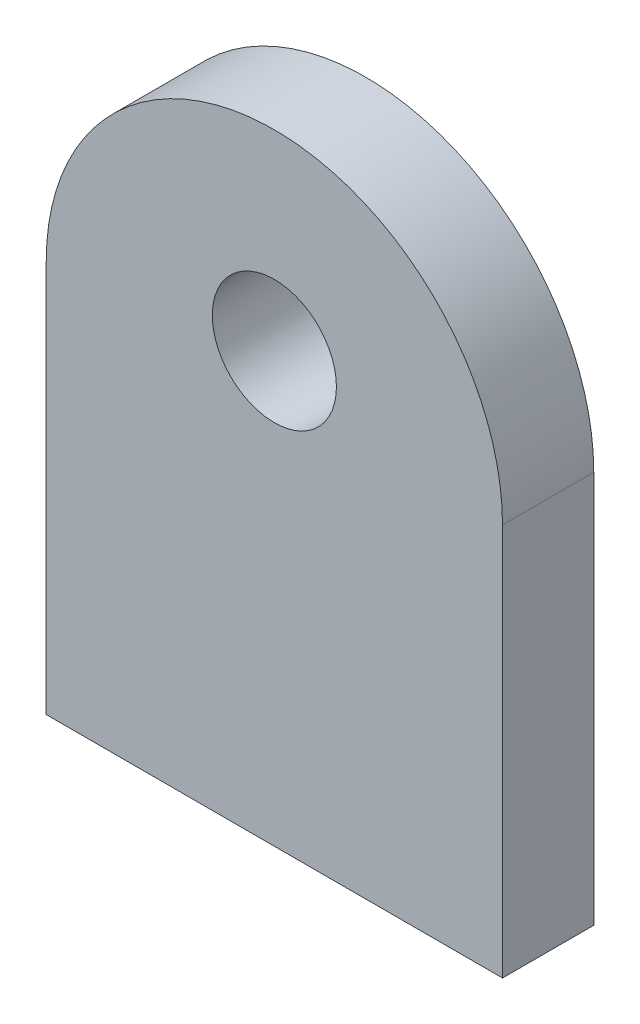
ISO-10303-21;
HEADER;
FILE_DESCRIPTION(('STEP AP214'),'2;1');
FILE_NAME('part.step','',(''),(''),'','','');
FILE_SCHEMA(('AUTOMOTIVE_DESIGN { 1 0 10303 214 1 1 1 1 }'));
ENDSEC;
DATA;
#1=APPLICATION_CONTEXT('core data for automotive mechanical design processes');
#2=APPLICATION_PROTOCOL_DEFINITION('international standard','automotive_design',2000,#1);
#3=PRODUCT_CONTEXT('',#1,'mechanical');
#4=PRODUCT('Part','Part','',(#3));
#5=PRODUCT_RELATED_PRODUCT_CATEGORY('part','',(#4));
#6=PRODUCT_DEFINITION_FORMATION('','',#4);
#7=PRODUCT_DEFINITION_CONTEXT('part definition',#1,'design');
#8=PRODUCT_DEFINITION('design','',#6,#7);
#9=PRODUCT_DEFINITION_SHAPE('','',#8);
#10=(LENGTH_UNIT() NAMED_UNIT(*) SI_UNIT(.MILLI.,.METRE.));
#11=(NAMED_UNIT(*) PLANE_ANGLE_UNIT() SI_UNIT($,.RADIAN.));
#12=(NAMED_UNIT(*) SI_UNIT($,.STERADIAN.) SOLID_ANGLE_UNIT());
#13=UNCERTAINTY_MEASURE_WITH_UNIT(LENGTH_MEASURE(1.E-05),#10,'distance_accuracy_value','');
#14=(GEOMETRIC_REPRESENTATION_CONTEXT(3) GLOBAL_UNCERTAINTY_ASSIGNED_CONTEXT((#13)) GLOBAL_UNIT_ASSIGNED_CONTEXT((#10,
#11,#12)) REPRESENTATION_CONTEXT('',''));
#15=CARTESIAN_POINT('',(0.,0.,0.));
#16=DIRECTION('',(0.,0.,1.));
#17=DIRECTION('',(1.,0.,0.));
#18=AXIS2_PLACEMENT_3D('',#15,#16,#17);
#19=CARTESIAN_POINT('',(-12.5,21.5,5.));
#20=DIRECTION('',(1.,0.,0.));
#21=DIRECTION('',(0.,1.,0.));
#22=AXIS2_PLACEMENT_3D('',#19,#20,#21);
#23=PLANE('',#22);
#24=DIRECTION('',(0.,-1.,0.));
#25=VECTOR('',#24,1.);
#26=CARTESIAN_POINT('',(-12.5,21.5,0.));
#27=LINE('',#26,#25);
#28=CARTESIAN_POINT('',(-12.5,21.5,0.));
#29=VERTEX_POINT('',#28);
#30=CARTESIAN_POINT('',(-12.5,0.,0.));
#31=VERTEX_POINT('',#30);
#32=EDGE_CURVE('E97',#29,#31,#27,.T.);
#33=ORIENTED_EDGE('',*,*,#32,.T.);
#34=DIRECTION('',(0.,0.,-1.));
#35=VECTOR('',#34,1.);
#36=CARTESIAN_POINT('',(-12.5,0.,5.));
#37=LINE('',#36,#35);
#38=CARTESIAN_POINT('',(-12.5,0.,5.));
#39=VERTEX_POINT('',#38);
#40=EDGE_CURVE('E11',#39,#31,#37,.T.);
#41=ORIENTED_EDGE('',*,*,#40,.F.);
#42=DIRECTION('',(0.,-1.,0.));
#43=VECTOR('',#42,1.);
#44=CARTESIAN_POINT('',(-12.5,21.5,5.));
#45=LINE('',#44,#43);
#46=CARTESIAN_POINT('',(-12.5,21.5,5.));
#47=VERTEX_POINT('',#46);
#48=EDGE_CURVE('E85',#47,#39,#45,.T.);
#49=ORIENTED_EDGE('',*,*,#48,.F.);
#50=DIRECTION('',(0.,0.,-1.));
#51=VECTOR('',#50,1.);
#52=CARTESIAN_POINT('',(-12.5,21.5,5.));
#53=LINE('',#52,#51);
#54=EDGE_CURVE('E93',#47,#29,#53,.T.);
#55=ORIENTED_EDGE('',*,*,#54,.T.);
#56=EDGE_LOOP('',(#33,#41,#49,#55));
#57=FACE_BOUND('',#56,.T.);
#58=ADVANCED_FACE('F34',(#57),#23,.F.);
#59=CARTESIAN_POINT('',(-12.5,0.,5.));
#60=DIRECTION('',(0.,1.,0.));
#61=DIRECTION('',(-1.,0.,0.));
#62=AXIS2_PLACEMENT_3D('',#59,#60,#61);
#63=PLANE('',#62);
#64=DIRECTION('',(1.,0.,0.));
#65=VECTOR('',#64,1.);
#66=CARTESIAN_POINT('',(-12.5,0.,0.));
#67=LINE('',#66,#65);
#68=CARTESIAN_POINT('',(12.5,0.,0.));
#69=VERTEX_POINT('',#68);
#70=EDGE_CURVE('E89',#31,#69,#67,.T.);
#71=ORIENTED_EDGE('',*,*,#70,.T.);
#72=DIRECTION('',(0.,0.,-1.));
#73=VECTOR('',#72,1.);
#74=CARTESIAN_POINT('',(12.5,0.,5.));
#75=LINE('',#74,#73);
#76=CARTESIAN_POINT('',(12.5,0.,5.));
#77=VERTEX_POINT('',#76);
#78=EDGE_CURVE('E42',#77,#69,#75,.T.);
#79=ORIENTED_EDGE('',*,*,#78,.F.);
#80=DIRECTION('',(1.,0.,0.));
#81=VECTOR('',#80,1.);
#82=CARTESIAN_POINT('',(-12.5,0.,5.));
#83=LINE('',#82,#81);
#84=EDGE_CURVE('E80',#39,#77,#83,.T.);
#85=ORIENTED_EDGE('',*,*,#84,.F.);
#86=ORIENTED_EDGE('',*,*,#40,.T.);
#87=EDGE_LOOP('',(#71,#79,#85,#86));
#88=FACE_BOUND('',#87,.T.);
#89=ADVANCED_FACE('F88',(#88),#63,.F.);
#90=CARTESIAN_POINT('',(12.5,0.,5.));
#91=DIRECTION('',(-1.,0.,0.));
#92=DIRECTION('',(0.,-1.,0.));
#93=AXIS2_PLACEMENT_3D('',#90,#91,#92);
#94=PLANE('',#93);
#95=DIRECTION('',(0.,1.,0.));
#96=VECTOR('',#95,1.);
#97=CARTESIAN_POINT('',(12.5,0.,0.));
#98=LINE('',#97,#96);
#99=CARTESIAN_POINT('',(12.5,21.5,0.));
#100=VERTEX_POINT('',#99);
#101=EDGE_CURVE('E67',#69,#100,#98,.T.);
#102=ORIENTED_EDGE('',*,*,#101,.T.);
#103=DIRECTION('',(0.,0.,-1.));
#104=VECTOR('',#103,1.);
#105=CARTESIAN_POINT('',(12.5,21.5,5.));
#106=LINE('',#105,#104);
#107=CARTESIAN_POINT('',(12.5,21.5,5.));
#108=VERTEX_POINT('',#107);
#109=EDGE_CURVE('E90',#108,#100,#106,.T.);
#110=ORIENTED_EDGE('',*,*,#109,.F.);
#111=DIRECTION('',(0.,1.,0.));
#112=VECTOR('',#111,1.);
#113=CARTESIAN_POINT('',(12.5,0.,5.));
#114=LINE('',#113,#112);
#115=EDGE_CURVE('E83',#77,#108,#114,.T.);
#116=ORIENTED_EDGE('',*,*,#115,.F.);
#117=ORIENTED_EDGE('',*,*,#78,.T.);
#118=EDGE_LOOP('',(#102,#110,#116,#117));
#119=FACE_BOUND('',#118,.T.);
#120=ADVANCED_FACE('F91',(#119),#94,.F.);
#121=CARTESIAN_POINT('',(0.,21.5,5.));
#122=DIRECTION('',(0.,0.,-1.));
#123=DIRECTION('',(-1.,0.,0.));
#124=AXIS2_PLACEMENT_3D('',#121,#122,#123);
#125=CYLINDRICAL_SURFACE('',#124,12.5);
#126=CARTESIAN_POINT('',(0.,21.5,0.));
#127=DIRECTION('',(0.,0.,1.));
#128=DIRECTION('',(1.,0.,0.));
#129=AXIS2_PLACEMENT_3D('',#126,#127,#128);
#130=CIRCLE('',#129,12.5);
#131=EDGE_CURVE('E73',#100,#29,#130,.T.);
#132=ORIENTED_EDGE('',*,*,#131,.T.);
#133=ORIENTED_EDGE('',*,*,#54,.F.);
#134=CARTESIAN_POINT('',(0.,21.5,5.));
#135=DIRECTION('',(0.,0.,1.));
#136=DIRECTION('',(1.,0.,0.));
#137=AXIS2_PLACEMENT_3D('',#134,#135,#136);
#138=CIRCLE('',#137,12.5);
#139=EDGE_CURVE('E50',#108,#47,#138,.T.);
#140=ORIENTED_EDGE('',*,*,#139,.F.);
#141=ORIENTED_EDGE('',*,*,#109,.T.);
#142=EDGE_LOOP('',(#132,#133,#140,#141));
#143=FACE_BOUND('',#142,.T.);
#144=ADVANCED_FACE('F105',(#143),#125,.T.);
#145=CARTESIAN_POINT('',(0.,21.5,5.));
#146=DIRECTION('',(0.,0.,1.));
#147=DIRECTION('',(1.,0.,0.));
#148=AXIS2_PLACEMENT_3D('',#145,#146,#147);
#149=PLANE('',#148);
#150=CARTESIAN_POINT('',(0.,23.5,5.));
#151=DIRECTION('',(0.,0.,1.));
#152=DIRECTION('',(1.,0.,0.));
#153=AXIS2_PLACEMENT_3D('',#150,#151,#152);
#154=CIRCLE('',#153,3.39999999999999);
#155=CARTESIAN_POINT('',(3.39999999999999,23.5,5.));
#156=VERTEX_POINT('',#155);
#157=EDGE_CURVE('E113',#156,#156,#154,.T.);
#158=ORIENTED_EDGE('',*,*,#157,.F.);
#159=EDGE_LOOP('',(#158));
#160=FACE_BOUND('',#159,.T.);
#161=ORIENTED_EDGE('',*,*,#48,.T.);
#162=ORIENTED_EDGE('',*,*,#84,.T.);
#163=ORIENTED_EDGE('',*,*,#115,.T.);
#164=ORIENTED_EDGE('',*,*,#139,.T.);
#165=EDGE_LOOP('',(#161,#162,#163,#164));
#166=FACE_BOUND('',#165,.T.);
#167=ADVANCED_FACE('F81',(#160,#166),#149,.T.);
#168=CARTESIAN_POINT('',(0.,21.5,0.));
#169=DIRECTION('',(0.,0.,1.));
#170=DIRECTION('',(1.,0.,0.));
#171=AXIS2_PLACEMENT_3D('',#168,#169,#170);
#172=PLANE('',#171);
#173=CARTESIAN_POINT('',(0.,23.5,0.));
#174=DIRECTION('',(0.,0.,1.));
#175=DIRECTION('',(1.,0.,0.));
#176=AXIS2_PLACEMENT_3D('',#173,#174,#175);
#177=CIRCLE('',#176,3.4);
#178=CARTESIAN_POINT('',(3.4,23.5,0.));
#179=VERTEX_POINT('',#178);
#180=EDGE_CURVE('E100',#179,#179,#177,.T.);
#181=ORIENTED_EDGE('',*,*,#180,.T.);
#182=EDGE_LOOP('',(#181));
#183=FACE_BOUND('',#182,.T.);
#184=ORIENTED_EDGE('',*,*,#32,.F.);
#185=ORIENTED_EDGE('',*,*,#131,.F.);
#186=ORIENTED_EDGE('',*,*,#101,.F.);
#187=ORIENTED_EDGE('',*,*,#70,.F.);
#188=EDGE_LOOP('',(#184,#185,#186,#187));
#189=FACE_BOUND('',#188,.T.);
#190=ADVANCED_FACE('F108',(#183,#189),#172,.F.);
#191=CARTESIAN_POINT('',(0.,23.5,5.));
#192=DIRECTION('',(0.,0.,1.));
#193=DIRECTION('',(1.,0.,0.));
#194=AXIS2_PLACEMENT_3D('',#191,#192,#193);
#195=CYLINDRICAL_SURFACE('',#194,3.39999999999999);
#196=ORIENTED_EDGE('',*,*,#180,.F.);
#197=EDGE_LOOP('',(#196));
#198=FACE_BOUND('',#197,.T.);
#199=ORIENTED_EDGE('',*,*,#157,.T.);
#200=EDGE_LOOP('',(#199));
#201=FACE_BOUND('',#200,.T.);
#202=ADVANCED_FACE('F117',(#198,#201),#195,.F.);
#203=CLOSED_SHELL('',(#58,#89,#120,#144,#167,#190,#202));
#204=MANIFOLD_SOLID_BREP('B2',#203);
#205=ADVANCED_BREP_SHAPE_REPRESENTATION('',(#18,#204),#14);
#206=SHAPE_DEFINITION_REPRESENTATION(#9,#205);
ENDSEC;
END-ISO-10303-21;
